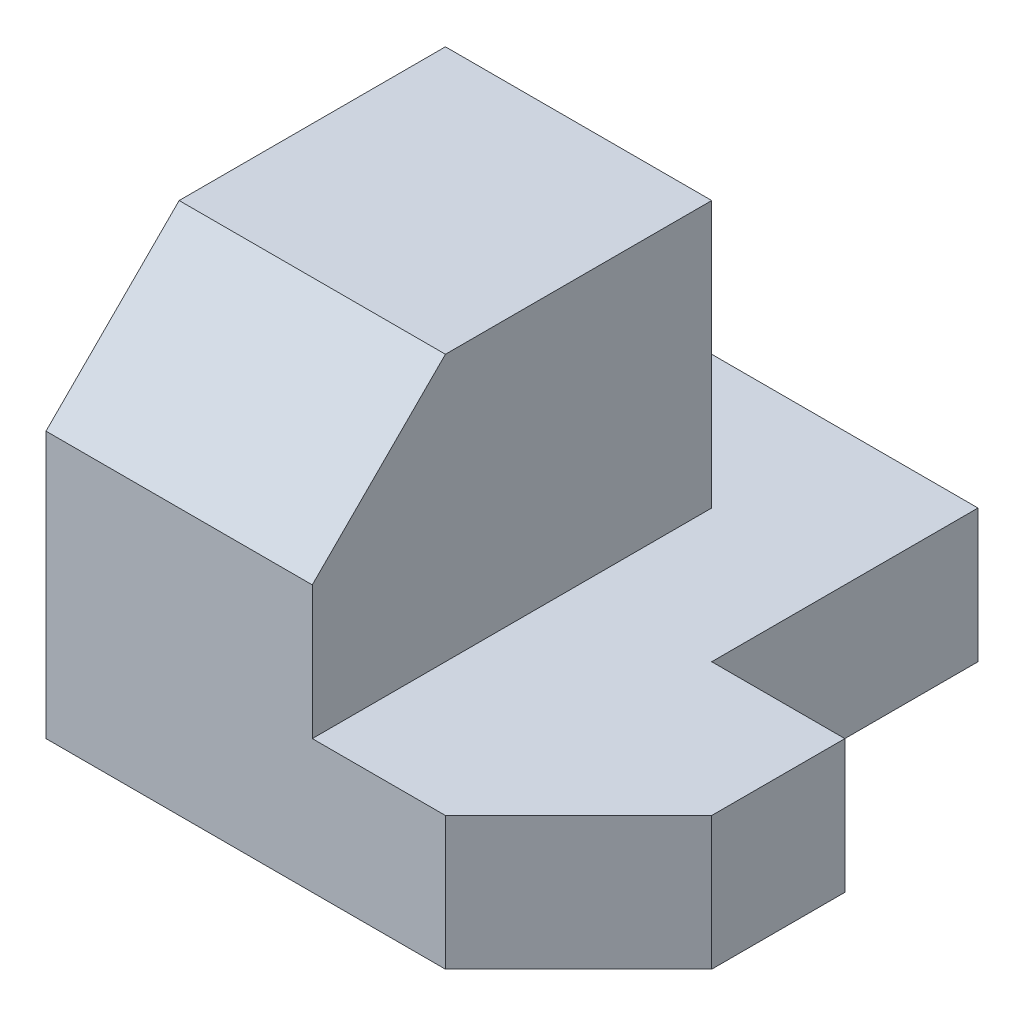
from build123d import *

# Parameters (mm, degrees)
EXTRUDE1_DEPTH = 10
SKETCH2_W      = 20
SKETCH2_H      = 30
EXTRUDE2_DEPTH = 20
CHAMFER1_SIZE  = 10


with BuildPart() as part:
    # Sketch1 → Extrude1 (new body)
    with BuildSketch(Plane(origin=(0, 0, 0), x_dir=(1, 0, 0), z_dir=(0, 1, 0))):
        Polygon((0, 0), (0, -40), (30, -40), (40, -30), (40, -20), (30, -20), (30, 0), align=None)
    extrude(amount=EXTRUDE1_DEPTH)

    # Sketch2 → Extrude2 (add)
    with BuildSketch(Plane(origin=(0, 10, 0), x_dir=(1, 0, 0), z_dir=(0, 1, 0))):
        with Locations((10, -25)):
            Rectangle(SKETCH2_W, SKETCH2_H)
    extrude(amount=EXTRUDE2_DEPTH)

    # Chamfer1
    chamfer1_edges = [part.edges().sort_by_distance(p)[0] for p in [
        (10, 30, 40),
    ]]
    chamfer(chamfer1_edges, length=CHAMFER1_SIZE)


solid = part.part
